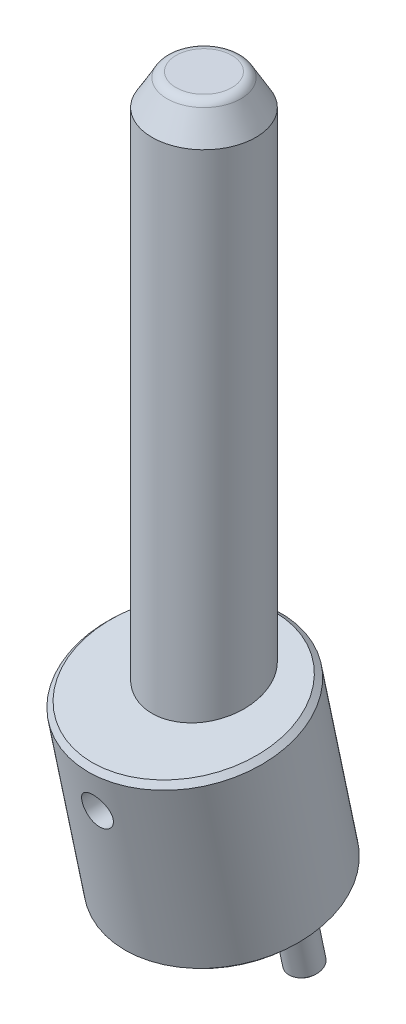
ISO-10303-21;
HEADER;
FILE_DESCRIPTION(('STEP AP214'),'2;1');
FILE_NAME('part.step','',(''),(''),'','','');
FILE_SCHEMA(('AUTOMOTIVE_DESIGN { 1 0 10303 214 1 1 1 1 }'));
ENDSEC;
DATA;
#1=APPLICATION_CONTEXT('core data for automotive mechanical design processes');
#2=APPLICATION_PROTOCOL_DEFINITION('international standard','automotive_design',2000,#1);
#3=PRODUCT_CONTEXT('',#1,'mechanical');
#4=PRODUCT('Part','Part','',(#3));
#5=PRODUCT_RELATED_PRODUCT_CATEGORY('part','',(#4));
#6=PRODUCT_DEFINITION_FORMATION('','',#4);
#7=PRODUCT_DEFINITION_CONTEXT('part definition',#1,'design');
#8=PRODUCT_DEFINITION('design','',#6,#7);
#9=PRODUCT_DEFINITION_SHAPE('','',#8);
#10=(LENGTH_UNIT() NAMED_UNIT(*) SI_UNIT(.MILLI.,.METRE.));
#11=(NAMED_UNIT(*) PLANE_ANGLE_UNIT() SI_UNIT($,.RADIAN.));
#12=(NAMED_UNIT(*) SI_UNIT($,.STERADIAN.) SOLID_ANGLE_UNIT());
#13=UNCERTAINTY_MEASURE_WITH_UNIT(LENGTH_MEASURE(1.E-05),#10,'distance_accuracy_value','');
#14=(GEOMETRIC_REPRESENTATION_CONTEXT(3) GLOBAL_UNCERTAINTY_ASSIGNED_CONTEXT((#13)) GLOBAL_UNIT_ASSIGNED_CONTEXT((#10,
#11,#12)) REPRESENTATION_CONTEXT('',''));
#15=CARTESIAN_POINT('',(0.,0.,0.));
#16=DIRECTION('',(0.,0.,1.));
#17=DIRECTION('',(1.,0.,0.));
#18=AXIS2_PLACEMENT_3D('',#15,#16,#17);
#19=CARTESIAN_POINT('',(0.,130.,0.));
#20=DIRECTION('',(0.,1.,0.));
#21=DIRECTION('',(-1.,0.,0.));
#22=AXIS2_PLACEMENT_3D('',#19,#20,#21);
#23=PLANE('',#22);
#24=CARTESIAN_POINT('',(0.,130.,0.));
#25=DIRECTION('',(0.,-1.,0.));
#26=DIRECTION('',(0.,0.,-1.));
#27=AXIS2_PLACEMENT_3D('',#24,#25,#26);
#28=CIRCLE('',#27,5.381197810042);
#29=CARTESIAN_POINT('',(0.,130.,-5.3811978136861));
#30=VERTEX_POINT('',#29);
#31=CARTESIAN_POINT('',(0.,130.,5.3811978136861));
#32=VERTEX_POINT('',#31);
#33=EDGE_CURVE('P0_E38',#30,#32,#28,.T.);
#34=ORIENTED_EDGE('',*,*,#33,.F.);
#35=CARTESIAN_POINT('',(0.,130.,0.));
#36=DIRECTION('',(0.,-1.,0.));
#37=DIRECTION('',(0.,0.,1.));
#38=AXIS2_PLACEMENT_3D('',#35,#36,#37);
#39=CIRCLE('',#38,5.381197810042);
#40=EDGE_CURVE('P0_E42',#32,#30,#39,.T.);
#41=ORIENTED_EDGE('',*,*,#40,.F.);
#42=EDGE_LOOP('',(#34,#41));
#43=FACE_BOUND('',#42,.T.);
#44=ADVANCED_FACE('P0_F17',(#43),#23,.T.);
#45=CARTESIAN_POINT('',(0.,128.,0.));
#46=DIRECTION('',(0.,1.,0.));
#47=DIRECTION('',(0.00894115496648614,0.,0.999960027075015));
#48=AXIS2_PLACEMENT_3D('',#45,#46,#47);
#49=TOROIDAL_SURFACE('',#48,5.381197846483,2.);
#50=ORIENTED_EDGE('',*,*,#33,.T.);
#51=ORIENTED_EDGE('',*,*,#40,.T.);
#52=EDGE_LOOP('',(#50,#51));
#53=FACE_BOUND('',#52,.T.);
#54=CARTESIAN_POINT('',(0.,129.000000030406,0.));
#55=DIRECTION('',(0.,-1.,0.));
#56=DIRECTION('',(0.,0.,1.));
#57=AXIS2_PLACEMENT_3D('',#54,#55,#56);
#58=CIRCLE('',#57,7.11324863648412);
#59=CARTESIAN_POINT('',(0.,129.000000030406,7.11324863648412));
#60=VERTEX_POINT('',#59);
#61=EDGE_CURVE('P0_E48',#60,#60,#58,.T.);
#62=ORIENTED_EDGE('',*,*,#61,.F.);
#63=EDGE_LOOP('',(#62));
#64=FACE_BOUND('',#63,.T.);
#65=ADVANCED_FACE('P0_F40',(#53,#64),#49,.T.);
#66=CARTESIAN_POINT('',(0.,0.,0.));
#67=DIRECTION('',(0.,1.,0.));
#68=DIRECTION('',(-1.,0.,0.));
#69=AXIS2_PLACEMENT_3D('',#66,#67,#68);
#70=PLANE('',#69);
#71=CARTESIAN_POINT('',(0.,8.84840740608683E-07,0.));
#72=DIRECTION('',(0.,1.,0.));
#73=DIRECTION('',(-1.,0.,0.));
#74=AXIS2_PLACEMENT_3D('',#71,#72,#73);
#75=CIRCLE('',#74,8.99999856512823);
#76=CARTESIAN_POINT('',(-8.99999856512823,8.84840740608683E-07,0.));
#77=VERTEX_POINT('',#76);
#78=EDGE_CURVE('P0_E85',#77,#77,#75,.T.);
#79=ORIENTED_EDGE('',*,*,#78,.F.);
#80=EDGE_LOOP('',(#79));
#81=FACE_BOUND('',#80,.T.);
#82=ADVANCED_FACE('P0_F76',(#81),#70,.F.);
#83=CARTESIAN_POINT('',(0.,17.,3.73205080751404));
#84=DIRECTION('',(0.,0.,1.));
#85=DIRECTION('',(-1.,0.,0.));
#86=AXIS2_PLACEMENT_3D('',#83,#84,#85);
#87=CONICAL_SURFACE('',#86,2.99999999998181,1.04719755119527);
#88=CARTESIAN_POINT('',(0.,16.9999999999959,1.99999999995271));
#89=VERTEX_POINT('',#88);
#90=VERTEX_LOOP('',#89);
#91=FACE_BOUND('',#90,.T.);
#92=CARTESIAN_POINT('',(0.,17.,3.732050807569));
#93=DIRECTION('',(0.,0.,1.));
#94=DIRECTION('',(0.,-1.,0.));
#95=AXIS2_PLACEMENT_3D('',#92,#93,#94);
#96=CIRCLE('',#95,3.);
#97=CARTESIAN_POINT('',(0.,14.,3.732050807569));
#98=VERTEX_POINT('',#97);
#99=EDGE_CURVE('P0_E82',#98,#98,#96,.T.);
#100=ORIENTED_EDGE('',*,*,#99,.T.);
#101=EDGE_LOOP('',(#100));
#102=FACE_BOUND('',#101,.T.);
#103=ADVANCED_FACE('P0_F116',(#91,#102),#87,.F.);
#104=CARTESIAN_POINT('',(0.,123.999999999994,0.));
#105=DIRECTION('',(0.,-1.,0.));
#106=DIRECTION('',(1.,0.,0.));
#107=AXIS2_PLACEMENT_3D('',#104,#105,#106);
#108=CONICAL_SURFACE('',#107,9.9999999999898,0.5235987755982);
#109=CARTESIAN_POINT('',(0.,124.,0.));
#110=DIRECTION('',(0.,1.,0.));
#111=DIRECTION('',(-1.,0.,0.));
#112=AXIS2_PLACEMENT_3D('',#109,#110,#111);
#113=CIRCLE('',#112,10.);
#114=CARTESIAN_POINT('',(-10.,124.,0.));
#115=VERTEX_POINT('',#114);
#116=EDGE_CURVE('P0_E92',#115,#115,#113,.F.);
#117=ORIENTED_EDGE('',*,*,#116,.F.);
#118=EDGE_LOOP('',(#117));
#119=FACE_BOUND('',#118,.T.);
#120=ORIENTED_EDGE('',*,*,#61,.T.);
#121=EDGE_LOOP('',(#120));
#122=FACE_BOUND('',#121,.T.);
#123=ADVANCED_FACE('P0_F108',(#119,#122),#108,.T.);
#124=CARTESIAN_POINT('',(0.,1.00000159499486,0.));
#125=DIRECTION('',(0.,1.,0.));
#126=DIRECTION('',(-1.,0.,0.));
#127=AXIS2_PLACEMENT_3D('',#124,#125,#126);
#128=CONICAL_SURFACE('',#127,9.99999901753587,0.785398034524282);
#129=CARTESIAN_POINT('',(0.,1.000000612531,0.));
#130=DIRECTION('',(0.,1.,0.));
#131=DIRECTION('',(-1.,0.,0.));
#132=AXIS2_PLACEMENT_3D('',#129,#130,#131);
#133=CIRCLE('',#132,10.);
#134=CARTESIAN_POINT('',(-10.,1.000000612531,0.));
#135=VERTEX_POINT('',#134);
#136=EDGE_CURVE('P0_E28',#135,#135,#133,.T.);
#137=ORIENTED_EDGE('',*,*,#136,.F.);
#138=EDGE_LOOP('',(#137));
#139=FACE_BOUND('',#138,.T.);
#140=ORIENTED_EDGE('',*,*,#78,.T.);
#141=EDGE_LOOP('',(#140));
#142=FACE_BOUND('',#141,.T.);
#143=ADVANCED_FACE('P0_F105',(#139,#142),#128,.T.);
#144=CARTESIAN_POINT('',(0.,17.,1.5));
#145=DIRECTION('',(0.,0.,1.));
#146=DIRECTION('',(0.,-1.,0.));
#147=AXIS2_PLACEMENT_3D('',#144,#145,#146);
#148=CYLINDRICAL_SURFACE('',#147,3.);
#149=ORIENTED_EDGE('',*,*,#99,.F.);
#150=EDGE_LOOP('',(#149));
#151=FACE_BOUND('',#150,.T.);
#152=CARTESIAN_POINT('',(0.,14.,10.));
#153=CARTESIAN_POINT('',(-0.164364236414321,14.0000089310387,9.99999407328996));
#154=CARTESIAN_POINT('',(-0.328908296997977,14.0135695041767,9.99590322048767));
#155=CARTESIAN_POINT('',(-0.653366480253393,14.0673818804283,9.9799606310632));
#156=CARTESIAN_POINT('',(-0.813271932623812,14.1076806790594,9.96809523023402));
#157=CARTESIAN_POINT('',(-1.12348315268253,14.2135007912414,9.93790838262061));
#158=CARTESIAN_POINT('',(-1.27380789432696,14.2789703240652,9.91960019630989));
#159=CARTESIAN_POINT('',(-1.56129290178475,14.4330996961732,9.87843514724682));
#160=CARTESIAN_POINT('',(-1.69845550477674,14.5217554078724,9.85557909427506));
#161=CARTESIAN_POINT('',(-1.95973946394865,14.7224452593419,9.80701539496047));
#162=CARTESIAN_POINT('',(-2.08342924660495,14.8350271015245,9.78124907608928));
#163=CARTESIAN_POINT('',(-2.31049290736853,15.0792112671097,9.73011807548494));
#164=CARTESIAN_POINT('',(-2.41386225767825,15.2108178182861,9.70475348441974));
#165=CARTESIAN_POINT('',(-2.59960101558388,15.4929419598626,9.65668220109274));
#166=CARTESIAN_POINT('',(-2.68144668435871,15.6438178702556,9.63404799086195));
#167=CARTESIAN_POINT('',(-2.81842825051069,15.9579795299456,9.59487230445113));
#168=CARTESIAN_POINT('',(-2.87357072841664,16.1212622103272,9.57832932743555));
#169=CARTESIAN_POINT('',(-2.95403265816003,16.4507804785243,9.5538174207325));
#170=CARTESIAN_POINT('',(-2.98014390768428,16.6168053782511,9.54562139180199));
#171=CARTESIAN_POINT('',(-3.00427461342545,16.9510662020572,9.53805579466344));
#172=CARTESIAN_POINT('',(-3.00230085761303,17.1193015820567,9.53868409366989));
#173=CARTESIAN_POINT('',(-2.9709395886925,17.4467673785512,9.54849486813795));
#174=CARTESIAN_POINT('',(-2.94254427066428,17.6061036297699,9.55736772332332));
#175=CARTESIAN_POINT('',(-2.86074869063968,17.9176387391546,9.58216703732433));
#176=CARTESIAN_POINT('',(-2.80734582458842,18.0698368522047,9.59809423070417));
#177=CARTESIAN_POINT('',(-2.67631861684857,18.3652051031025,9.6354552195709));
#178=CARTESIAN_POINT('',(-2.59837186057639,18.5082226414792,9.65696160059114));
#179=CARTESIAN_POINT('',(-2.42069837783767,18.7794716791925,9.70302119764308));
#180=CARTESIAN_POINT('',(-2.32096766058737,18.9077004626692,9.7275749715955));
#181=CARTESIAN_POINT('',(-2.09764727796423,19.1513495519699,9.77821549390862));
#182=CARTESIAN_POINT('',(-1.97323765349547,19.2660150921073,9.80432352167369));
#183=CARTESIAN_POINT('',(-1.7065766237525,19.4730741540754,9.85423611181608));
#184=CARTESIAN_POINT('',(-1.56431758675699,19.5654580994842,9.87803968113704));
#185=CARTESIAN_POINT('',(-1.26458300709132,19.7257915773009,9.92088257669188));
#186=CARTESIAN_POINT('',(-1.10700242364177,19.7935547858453,9.93988525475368));
#187=CARTESIAN_POINT('',(-0.782158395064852,19.9012737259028,9.97069163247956));
#188=CARTESIAN_POINT('',(-0.61491570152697,19.9412868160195,9.9825101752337));
#189=CARTESIAN_POINT('',(-0.371824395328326,19.9778051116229,9.99335985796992));
#190=CARTESIAN_POINT('',(-0.297737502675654,19.9861188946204,9.99584304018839));
#191=CARTESIAN_POINT('',(-0.14911274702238,19.9972183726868,9.99916445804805));
#192=CARTESIAN_POINT('',(-0.0745748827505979,20.000004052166,10.0000026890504));
#193=CARTESIAN_POINT('',(0.164364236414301,19.9999910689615,9.99999407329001));
#194=CARTESIAN_POINT('',(0.328908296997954,19.9864304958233,9.99590322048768));
#195=CARTESIAN_POINT('',(0.653366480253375,19.9326181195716,9.97996063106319));
#196=CARTESIAN_POINT('',(0.813271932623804,19.8923193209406,9.96809523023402));
#197=CARTESIAN_POINT('',(1.12348315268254,19.7864992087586,9.93790838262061));
#198=CARTESIAN_POINT('',(1.27380789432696,19.7210296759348,9.91960019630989));
#199=CARTESIAN_POINT('',(1.56129290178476,19.5669003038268,9.87843514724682));
#200=CARTESIAN_POINT('',(1.69845550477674,19.4782445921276,9.85557909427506));
#201=CARTESIAN_POINT('',(1.95973946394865,19.2775547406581,9.80701539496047));
#202=CARTESIAN_POINT('',(2.08342924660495,19.1649728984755,9.78124907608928));
#203=CARTESIAN_POINT('',(2.31049290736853,18.9207887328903,9.73011807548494));
#204=CARTESIAN_POINT('',(2.41386225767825,18.7891821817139,9.70475348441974));
#205=CARTESIAN_POINT('',(2.59960101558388,18.5070580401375,9.65668220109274));
#206=CARTESIAN_POINT('',(2.68144668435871,18.3561821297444,9.63404799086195));
#207=CARTESIAN_POINT('',(2.81842825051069,18.0420204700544,9.59487230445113));
#208=CARTESIAN_POINT('',(2.87357072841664,17.8787377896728,9.57832932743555));
#209=CARTESIAN_POINT('',(2.95403265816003,17.5492195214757,9.5538174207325));
#210=CARTESIAN_POINT('',(2.98014390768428,17.3831946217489,9.54562139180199));
#211=CARTESIAN_POINT('',(3.00427461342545,17.0489337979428,9.53805579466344));
#212=CARTESIAN_POINT('',(3.00230085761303,16.8806984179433,9.53868409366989));
#213=CARTESIAN_POINT('',(2.9709395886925,16.5532326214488,9.54849486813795));
#214=CARTESIAN_POINT('',(2.94254427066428,16.3938963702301,9.55736772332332));
#215=CARTESIAN_POINT('',(2.86074869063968,16.0823612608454,9.58216703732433));
#216=CARTESIAN_POINT('',(2.80734582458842,15.9301631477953,9.59809423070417));
#217=CARTESIAN_POINT('',(2.67631861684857,15.6347948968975,9.6354552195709));
#218=CARTESIAN_POINT('',(2.59837186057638,15.4917773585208,9.65696160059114));
#219=CARTESIAN_POINT('',(2.42069837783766,15.2205283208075,9.70302119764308));
#220=CARTESIAN_POINT('',(2.32096766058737,15.0922995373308,9.7275749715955));
#221=CARTESIAN_POINT('',(2.09764727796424,14.8486504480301,9.77821549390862));
#222=CARTESIAN_POINT('',(1.97323765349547,14.7339849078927,9.80432352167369));
#223=CARTESIAN_POINT('',(1.7065766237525,14.5269258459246,9.85423611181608));
#224=CARTESIAN_POINT('',(1.56431758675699,14.4345419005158,9.87803968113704));
#225=CARTESIAN_POINT('',(1.26458300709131,14.2742084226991,9.92088257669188));
#226=CARTESIAN_POINT('',(1.10700242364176,14.2064452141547,9.93988525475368));
#227=CARTESIAN_POINT('',(0.782158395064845,14.0987262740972,9.97069163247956));
#228=CARTESIAN_POINT('',(0.614915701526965,14.0587131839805,9.9825101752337));
#229=CARTESIAN_POINT('',(0.371824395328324,14.0221948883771,9.99335985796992));
#230=CARTESIAN_POINT('',(0.297737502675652,14.0138811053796,9.9958430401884));
#231=CARTESIAN_POINT('',(0.149112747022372,14.0027816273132,9.99916445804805));
#232=CARTESIAN_POINT('',(0.0745748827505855,13.999995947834,10.0000026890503));
#233=CARTESIAN_POINT('',(0.,14.,10.));
#234=B_SPLINE_CURVE_WITH_KNOTS('',3,(#152,#153,#154,#155,#156,#157,#158,#159,#160,#161,#162,
#163,#164,#165,#166,#167,#168,#169,#170,#171,#172,#173,#174,#175,#176,#177,#178,#179,#180,#181,
#182,#183,#184,#185,#186,#187,#188,#189,#190,#191,#192,#193,#194,#195,#196,#197,#198,#199,#200,
#201,#202,#203,#204,#205,#206,#207,#208,#209,#210,#211,#212,#213,#214,#215,#216,#217,#218,#219,
#220,#221,#222,#223,#224,#225,#226,#227,#228,#229,#230,#231,#232,#233),.UNSPECIFIED.,.T.,.F.,(4,
2,2,2,2,2,2,2,2,2,2,2,2,2,2,2,2,2,2,2,2,2,2,2,2,2,2,2,2,2,2,2,2,2,2,2,2,2,2,2,4),(0.,
0.49280574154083,0.98647994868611,1.47914396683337,1.97172034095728,2.47709830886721,
2.98258875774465,3.49943124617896,4.01614630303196,4.51839363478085,5.02051957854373,
5.50451902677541,5.98856888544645,6.47926306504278,6.97004721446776,7.48124851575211,
7.99266913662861,8.507883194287,9.02202912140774,9.24562293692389,9.4692173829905,
9.96202312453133,10.4556973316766,10.9483613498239,11.4409377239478,11.9463156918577,
12.4518061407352,12.9686486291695,13.4853636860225,13.9876110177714,14.4897369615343,
14.9737364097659,15.457786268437,15.9484804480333,16.4392645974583,16.9504658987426,
17.4618865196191,17.9771005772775,18.4912465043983,18.7148403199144,18.938434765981),.UNSPECIFIED.);
#235=CARTESIAN_POINT('',(0.,14.,10.));
#236=VERTEX_POINT('',#235);
#237=EDGE_CURVE('P0_E11',#236,#236,#234,.T.);
#238=ORIENTED_EDGE('',*,*,#237,.F.);
#239=EDGE_LOOP('',(#238));
#240=FACE_BOUND('',#239,.T.);
#241=ADVANCED_FACE('P0_F107',(#151,#240),#148,.F.);
#242=CARTESIAN_POINT('',(0.,-6.5,0.));
#243=DIRECTION('',(0.,1.,0.));
#244=DIRECTION('',(-1.,0.,0.));
#245=AXIS2_PLACEMENT_3D('',#242,#243,#244);
#246=CYLINDRICAL_SURFACE('',#245,10.);
#247=ORIENTED_EDGE('',*,*,#116,.T.);
#248=EDGE_LOOP('',(#247));
#249=FACE_BOUND('',#248,.T.);
#250=ORIENTED_EDGE('',*,*,#136,.T.);
#251=EDGE_LOOP('',(#250));
#252=FACE_BOUND('',#251,.T.);
#253=ORIENTED_EDGE('',*,*,#237,.T.);
#254=EDGE_LOOP('',(#253));
#255=FACE_BOUND('',#254,.T.);
#256=ADVANCED_FACE('P0_F102',(#249,#252,#255),#246,.T.);
#257=CLOSED_SHELL('',(#44,#65,#82,#103,#123,#143,#241,#256));
#258=MANIFOLD_SOLID_BREP('P0_B1',#257);
#259=CARTESIAN_POINT('',(0.,-14.8482887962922,-5.4434356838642));
#260=DIRECTION('',(0.,-0.978147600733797,-0.207911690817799));
#261=DIRECTION('',(0.,0.207911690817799,-0.978147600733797));
#262=AXIS2_PLACEMENT_3D('',#259,#260,#261);
#263=PLANE('',#262);
#264=CARTESIAN_POINT('',(-14.,-14.8482887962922,-5.4434356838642));
#265=DIRECTION('',(0.,-0.978147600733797,-0.207911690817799));
#266=DIRECTION('',(0.,0.207911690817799,-0.978147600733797));
#267=AXIS2_PLACEMENT_3D('',#264,#265,#266);
#268=CIRCLE('',#267,2.49998893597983);
#269=CARTESIAN_POINT('',(-14.,-14.3285118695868,-7.8887938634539));
#270=VERTEX_POINT('',#269);
#271=EDGE_CURVE('P1_E17',#270,#270,#268,.F.);
#272=ORIENTED_EDGE('',*,*,#271,.F.);
#273=EDGE_LOOP('',(#272));
#274=FACE_BOUND('',#273,.T.);
#275=ADVANCED_FACE('P1_F14',(#274),#263,.T.);
#276=CARTESIAN_POINT('',(0.,-14.8482887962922,-5.4434356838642));
#277=DIRECTION('',(0.,-0.978147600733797,-0.207911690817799));
#278=DIRECTION('',(0.,0.207911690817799,-0.978147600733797));
#279=AXIS2_PLACEMENT_3D('',#276,#277,#278);
#280=PLANE('',#279);
#281=CARTESIAN_POINT('',(14.,-14.8482887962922,-5.4434356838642));
#282=DIRECTION('',(0.,-0.978147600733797,-0.207911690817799));
#283=DIRECTION('',(0.,0.207911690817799,-0.978147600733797));
#284=AXIS2_PLACEMENT_3D('',#281,#282,#283);
#285=CIRCLE('',#284,2.49998893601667);
#286=CARTESIAN_POINT('',(14.,-14.3285118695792,-7.88879386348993));
#287=VERTEX_POINT('',#286);
#288=EDGE_CURVE('P1_E114',#287,#287,#285,.F.);
#289=ORIENTED_EDGE('',*,*,#288,.F.);
#290=EDGE_LOOP('',(#289));
#291=FACE_BOUND('',#290,.T.);
#292=ADVANCED_FACE('P1_F104',(#291),#280,.T.);
#293=CARTESIAN_POINT('',(0.,0.,6.11490025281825E-13));
#294=DIRECTION('',(0.,-1.,0.));
#295=DIRECTION('',(0.,0.,-1.));
#296=AXIS2_PLACEMENT_3D('',#293,#294,#295);
#297=PLANE('',#296);
#298=CARTESIAN_POINT('',(0.,0.,2.39088263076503E-12));
#299=DIRECTION('',(0.,-1.,0.));
#300=DIRECTION('',(0.,0.,-1.));
#301=AXIS2_PLACEMENT_3D('',#298,#299,#300);
#302=CIRCLE('',#301,10.);
#303=CARTESIAN_POINT('',(0.,0.,-9.99999999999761));
#304=VERTEX_POINT('',#303);
#305=EDGE_CURVE('P1_E116',#304,#304,#302,.F.);
#306=ORIENTED_EDGE('',*,*,#305,.T.);
#307=EDGE_LOOP('',(#306));
#308=FACE_BOUND('',#307,.T.);
#309=ADVANCED_FACE('P1_F101',(#308),#297,.F.);
#310=CARTESIAN_POINT('',(-14.,-14.3592066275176,-5.33947805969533));
#311=DIRECTION('',(0.,0.978147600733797,0.207911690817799));
#312=DIRECTION('',(0.,-0.207911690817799,0.978147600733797));
#313=AXIS2_PLACEMENT_3D('',#310,#311,#312);
#314=CONICAL_SURFACE('',#313,2.99999527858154,0.785395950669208);
#315=CARTESIAN_POINT('',(-14.,-14.359202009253,-5.33947707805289));
#316=DIRECTION('',(0.,0.978147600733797,0.207911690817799));
#317=DIRECTION('',(0.,-0.207911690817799,0.978147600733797));
#318=AXIS2_PLACEMENT_3D('',#315,#316,#317);
#319=CIRCLE('',#318,3.);
#320=CARTESIAN_POINT('',(-14.,-14.9829370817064,-2.4050342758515));
#321=VERTEX_POINT('',#320);
#322=EDGE_CURVE('P1_E118',#321,#321,#319,.T.);
#323=ORIENTED_EDGE('',*,*,#322,.F.);
#324=EDGE_LOOP('',(#323));
#325=FACE_BOUND('',#324,.T.);
#326=ORIENTED_EDGE('',*,*,#271,.T.);
#327=EDGE_LOOP('',(#326));
#328=FACE_BOUND('',#327,.T.);
#329=ADVANCED_FACE('P1_F97',(#325,#328),#314,.T.);
#330=CARTESIAN_POINT('',(14.,-14.3592066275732,-5.33947805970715));
#331=DIRECTION('',(0.,0.978147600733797,0.207911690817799));
#332=DIRECTION('',(0.,-0.207911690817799,0.978147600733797));
#333=AXIS2_PLACEMENT_3D('',#330,#331,#332);
#334=CONICAL_SURFACE('',#333,2.99999527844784,0.785395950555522);
#335=CARTESIAN_POINT('',(14.,-14.3592020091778,-5.33947707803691));
#336=DIRECTION('',(0.,0.978147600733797,0.207911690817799));
#337=DIRECTION('',(0.,-0.207911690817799,0.978147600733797));
#338=AXIS2_PLACEMENT_3D('',#335,#336,#337);
#339=CIRCLE('',#338,3.);
#340=CARTESIAN_POINT('',(14.,-14.9829370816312,-2.40503427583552));
#341=VERTEX_POINT('',#340);
#342=EDGE_CURVE('P1_E123',#341,#341,#339,.T.);
#343=ORIENTED_EDGE('',*,*,#342,.F.);
#344=EDGE_LOOP('',(#343));
#345=FACE_BOUND('',#344,.T.);
#346=ORIENTED_EDGE('',*,*,#288,.T.);
#347=EDGE_LOOP('',(#346));
#348=FACE_BOUND('',#347,.T.);
#349=ADVANCED_FACE('P1_F92',(#345,#348),#334,.T.);
#350=CARTESIAN_POINT('',(0.,44.237051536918,2.39131631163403E-12));
#351=DIRECTION('',(0.,-1.,0.));
#352=DIRECTION('',(0.,0.,-1.));
#353=AXIS2_PLACEMENT_3D('',#350,#351,#352);
#354=CYLINDRICAL_SURFACE('',#353,10.);
#355=CARTESIAN_POINT('',(0.,29.9999999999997,2.39131631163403E-12));
#356=DIRECTION('',(0.,0.978147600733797,0.207911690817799));
#357=DIRECTION('',(0.,-0.207911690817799,0.978147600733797));
#358=AXIS2_PLACEMENT_3D('',#355,#356,#357);
#359=ELLIPSE('',#358,10.2234059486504,10.);
#360=CARTESIAN_POINT('',(0.,27.8744343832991,10.0000000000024));
#361=VERTEX_POINT('',#360);
#362=EDGE_CURVE('P1_E79',#361,#361,#359,.F.);
#363=ORIENTED_EDGE('',*,*,#362,.F.);
#364=EDGE_LOOP('',(#363));
#365=FACE_BOUND('',#364,.T.);
#366=ORIENTED_EDGE('',*,*,#305,.F.);
#367=EDGE_LOOP('',(#366));
#368=FACE_BOUND('',#367,.T.);
#369=CARTESIAN_POINT('',(0.,19.9999999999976,10.0000000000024));
#370=CARTESIAN_POINT('',(-0.16436423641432,19.9999910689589,9.99999407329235));
#371=CARTESIAN_POINT('',(-0.328908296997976,19.9864304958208,9.99590322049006));
#372=CARTESIAN_POINT('',(-0.653366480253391,19.9326181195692,9.97996063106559));
#373=CARTESIAN_POINT('',(-0.813271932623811,19.8923193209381,9.96809523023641));
#374=CARTESIAN_POINT('',(-1.12348315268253,19.7864992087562,9.937908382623));
#375=CARTESIAN_POINT('',(-1.27380789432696,19.7210296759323,9.91960019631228));
#376=CARTESIAN_POINT('',(-1.56129290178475,19.5669003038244,9.87843514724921));
#377=CARTESIAN_POINT('',(-1.69845550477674,19.4782445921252,9.85557909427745));
#378=CARTESIAN_POINT('',(-1.95973946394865,19.2775547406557,9.80701539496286));
#379=CARTESIAN_POINT('',(-2.08342924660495,19.1649728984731,9.78124907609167));
#380=CARTESIAN_POINT('',(-2.31049290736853,18.9207887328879,9.73011807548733));
#381=CARTESIAN_POINT('',(-2.41386225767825,18.7891821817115,9.70475348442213));
#382=CARTESIAN_POINT('',(-2.59960101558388,18.507058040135,9.65668220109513));
#383=CARTESIAN_POINT('',(-2.68144668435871,18.356182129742,9.63404799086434));
#384=CARTESIAN_POINT('',(-2.81842825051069,18.042020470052,9.59487230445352));
#385=CARTESIAN_POINT('',(-2.87357072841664,17.8787377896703,9.57832932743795));
#386=CARTESIAN_POINT('',(-2.95403265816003,17.5492195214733,9.55381742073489));
#387=CARTESIAN_POINT('',(-2.98014390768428,17.3831946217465,9.54562139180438));
#388=CARTESIAN_POINT('',(-3.00427461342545,17.0489337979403,9.53805579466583));
#389=CARTESIAN_POINT('',(-3.00230085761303,16.8806984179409,9.53868409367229));
#390=CARTESIAN_POINT('',(-2.9709395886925,16.5532326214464,9.54849486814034));
#391=CARTESIAN_POINT('',(-2.94254427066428,16.3938963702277,9.55736772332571));
#392=CARTESIAN_POINT('',(-2.86074869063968,16.082361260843,9.58216703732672));
#393=CARTESIAN_POINT('',(-2.80734582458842,15.9301631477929,9.59809423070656));
#394=CARTESIAN_POINT('',(-2.67631861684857,15.6347948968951,9.63545521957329));
#395=CARTESIAN_POINT('',(-2.59837186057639,15.4917773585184,9.65696160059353));
#396=CARTESIAN_POINT('',(-2.42069837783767,15.220528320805,9.70302119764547));
#397=CARTESIAN_POINT('',(-2.32096766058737,15.0922995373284,9.72757497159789));
#398=CARTESIAN_POINT('',(-2.09764727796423,14.8486504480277,9.77821549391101));
#399=CARTESIAN_POINT('',(-1.97323765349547,14.7339849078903,9.80432352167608));
#400=CARTESIAN_POINT('',(-1.7065766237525,14.5269258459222,9.85423611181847));
#401=CARTESIAN_POINT('',(-1.56431758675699,14.4345419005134,9.87803968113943));
#402=CARTESIAN_POINT('',(-1.26458300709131,14.2742084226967,9.92088257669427));
#403=CARTESIAN_POINT('',(-1.10700242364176,14.2064452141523,9.93988525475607));
#404=CARTESIAN_POINT('',(-0.78215839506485,14.0987262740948,9.97069163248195));
#405=CARTESIAN_POINT('',(-0.614915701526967,14.058713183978,9.9825101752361));
#406=CARTESIAN_POINT('',(-0.371824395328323,14.0221948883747,9.99335985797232));
#407=CARTESIAN_POINT('',(-0.297737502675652,14.0138811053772,9.99584304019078));
#408=CARTESIAN_POINT('',(-0.149112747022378,14.0027816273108,9.99916445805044));
#409=CARTESIAN_POINT('',(-0.0745748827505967,13.9999959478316,10.0000026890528));
#410=CARTESIAN_POINT('',(0.164364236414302,14.0000089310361,9.9999940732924));
#411=CARTESIAN_POINT('',(0.328908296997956,14.0135695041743,9.99590322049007));
#412=CARTESIAN_POINT('',(0.653366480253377,14.0673818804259,9.97996063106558));
#413=CARTESIAN_POINT('',(0.813271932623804,14.107680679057,9.96809523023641));
#414=CARTESIAN_POINT('',(1.12348315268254,14.213500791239,9.937908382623));
#415=CARTESIAN_POINT('',(1.27380789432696,14.2789703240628,9.91960019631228));
#416=CARTESIAN_POINT('',(1.56129290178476,14.4330996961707,9.87843514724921));
#417=CARTESIAN_POINT('',(1.69845550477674,14.52175540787,9.85557909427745));
#418=CARTESIAN_POINT('',(1.95973946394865,14.7224452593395,9.80701539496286));
#419=CARTESIAN_POINT('',(2.08342924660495,14.8350271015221,9.78124907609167));
#420=CARTESIAN_POINT('',(2.31049290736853,15.0792112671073,9.73011807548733));
#421=CARTESIAN_POINT('',(2.41386225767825,15.2108178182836,9.70475348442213));
#422=CARTESIAN_POINT('',(2.59960101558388,15.4929419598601,9.65668220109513));
#423=CARTESIAN_POINT('',(2.68144668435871,15.6438178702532,9.63404799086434));
#424=CARTESIAN_POINT('',(2.81842825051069,15.9579795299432,9.59487230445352));
#425=CARTESIAN_POINT('',(2.87357072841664,16.1212622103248,9.57832932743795));
#426=CARTESIAN_POINT('',(2.95403265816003,16.4507804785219,9.55381742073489));
#427=CARTESIAN_POINT('',(2.98014390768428,16.6168053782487,9.54562139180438));
#428=CARTESIAN_POINT('',(3.00427461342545,16.9510662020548,9.53805579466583));
#429=CARTESIAN_POINT('',(3.00230085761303,17.1193015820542,9.53868409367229));
#430=CARTESIAN_POINT('',(2.9709395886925,17.4467673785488,9.54849486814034));
#431=CARTESIAN_POINT('',(2.94254427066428,17.6061036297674,9.55736772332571));
#432=CARTESIAN_POINT('',(2.86074869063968,17.9176387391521,9.58216703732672));
#433=CARTESIAN_POINT('',(2.80734582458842,18.0698368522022,9.59809423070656));
#434=CARTESIAN_POINT('',(2.67631861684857,18.3652051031,9.63545521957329));
#435=CARTESIAN_POINT('',(2.59837186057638,18.5082226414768,9.65696160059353));
#436=CARTESIAN_POINT('',(2.42069837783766,18.7794716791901,9.70302119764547));
#437=CARTESIAN_POINT('',(2.32096766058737,18.9077004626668,9.72757497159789));
#438=CARTESIAN_POINT('',(2.09764727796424,19.1513495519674,9.77821549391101));
#439=CARTESIAN_POINT('',(1.97323765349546,19.2660150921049,9.80432352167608));
#440=CARTESIAN_POINT('',(1.70657662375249,19.473074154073,9.85423611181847));
#441=CARTESIAN_POINT('',(1.56431758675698,19.5654580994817,9.87803968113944));
#442=CARTESIAN_POINT('',(1.26458300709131,19.7257915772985,9.92088257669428));
#443=CARTESIAN_POINT('',(1.10700242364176,19.7935547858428,9.93988525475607));
#444=CARTESIAN_POINT('',(0.782158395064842,19.9012737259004,9.97069163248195));
#445=CARTESIAN_POINT('',(0.614915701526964,19.9412868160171,9.98251017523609));
#446=CARTESIAN_POINT('',(0.371824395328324,19.9778051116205,9.99335985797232));
#447=CARTESIAN_POINT('',(0.297737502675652,19.986118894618,9.99584304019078));
#448=CARTESIAN_POINT('',(0.149112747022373,19.9972183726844,9.99916445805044));
#449=CARTESIAN_POINT('',(0.0745748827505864,20.0000040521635,10.0000026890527));
#450=CARTESIAN_POINT('',(0.,19.9999999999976,10.0000000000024));
#451=B_SPLINE_CURVE_WITH_KNOTS('',3,(#369,#370,#371,#372,#373,#374,#375,#376,#377,#378,#379,
#380,#381,#382,#383,#384,#385,#386,#387,#388,#389,#390,#391,#392,#393,#394,#395,#396,#397,#398,
#399,#400,#401,#402,#403,#404,#405,#406,#407,#408,#409,#410,#411,#412,#413,#414,#415,#416,#417,
#418,#419,#420,#421,#422,#423,#424,#425,#426,#427,#428,#429,#430,#431,#432,#433,#434,#435,#436,
#437,#438,#439,#440,#441,#442,#443,#444,#445,#446,#447,#448,#449,#450),.UNSPECIFIED.,.T.,.F.,(4,
2,2,2,2,2,2,2,2,2,2,2,2,2,2,2,2,2,2,2,2,2,2,2,2,2,2,2,2,2,2,2,2,2,2,2,2,2,2,2,4),(0.,
0.49280574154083,0.986479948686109,1.47914396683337,1.97172034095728,2.47709830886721,
2.98258875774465,3.49943124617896,4.01614630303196,4.51839363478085,5.02051957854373,
5.50451902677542,5.98856888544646,6.47926306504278,6.97004721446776,7.48124851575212,
7.99266913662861,8.507883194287,9.02202912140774,9.2456229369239,9.46921738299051,
9.96202312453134,10.4556973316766,10.9483613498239,11.4409377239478,11.9463156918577,
12.4518061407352,12.9686486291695,13.4853636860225,13.9876110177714,14.4897369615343,
14.9737364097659,15.457786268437,15.9484804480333,16.4392645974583,16.9504658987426,
17.4618865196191,17.9771005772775,18.4912465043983,18.7148403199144,18.938434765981),.UNSPECIFIED.);
#452=CARTESIAN_POINT('',(0.,19.9999999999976,10.0000000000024));
#453=VERTEX_POINT('',#452);
#454=EDGE_CURVE('P1_E76',#453,#453,#451,.T.);
#455=ORIENTED_EDGE('',*,*,#454,.T.);
#456=EDGE_LOOP('',(#455));
#457=FACE_BOUND('',#456,.T.);
#458=ADVANCED_FACE('P1_F86',(#365,#368,#457),#354,.F.);
#459=CARTESIAN_POINT('',(-14.,-6.044960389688,-3.572230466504));
#460=DIRECTION('',(0.,-0.978147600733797,-0.207911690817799));
#461=DIRECTION('',(0.,0.207911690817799,-0.978147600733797));
#462=AXIS2_PLACEMENT_3D('',#459,#460,#461);
#463=CYLINDRICAL_SURFACE('',#462,3.);
#464=CARTESIAN_POINT('',(-14.,-6.044960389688,-3.572230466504));
#465=DIRECTION('',(0.,-0.978147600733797,-0.207911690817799));
#466=DIRECTION('',(0.,0.207911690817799,-0.978147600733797));
#467=AXIS2_PLACEMENT_3D('',#464,#465,#466);
#468=CIRCLE('',#467,3.);
#469=CARTESIAN_POINT('',(-14.,-5.4212253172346,-6.50667326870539));
#470=VERTEX_POINT('',#469);
#471=EDGE_CURVE('P1_E72',#470,#470,#468,.T.);
#472=ORIENTED_EDGE('',*,*,#471,.T.);
#473=EDGE_LOOP('',(#472));
#474=FACE_BOUND('',#473,.T.);
#475=ORIENTED_EDGE('',*,*,#322,.T.);
#476=EDGE_LOOP('',(#475));
#477=FACE_BOUND('',#476,.T.);
#478=ADVANCED_FACE('P1_F91',(#474,#477),#463,.T.);
#479=CARTESIAN_POINT('',(14.,-6.044960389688,-3.572230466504));
#480=DIRECTION('',(0.,-0.978147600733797,-0.207911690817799));
#481=DIRECTION('',(0.,0.207911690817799,-0.978147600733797));
#482=AXIS2_PLACEMENT_3D('',#479,#480,#481);
#483=CYLINDRICAL_SURFACE('',#482,3.);
#484=CARTESIAN_POINT('',(14.,-6.044960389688,-3.572230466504));
#485=DIRECTION('',(0.,-0.978147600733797,-0.207911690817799));
#486=DIRECTION('',(0.,0.207911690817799,-0.978147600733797));
#487=AXIS2_PLACEMENT_3D('',#484,#485,#486);
#488=CIRCLE('',#487,3.);
#489=CARTESIAN_POINT('',(14.,-5.4212253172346,-6.50667326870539));
#490=VERTEX_POINT('',#489);
#491=EDGE_CURVE('P1_E68',#490,#490,#488,.T.);
#492=ORIENTED_EDGE('',*,*,#491,.T.);
#493=EDGE_LOOP('',(#492));
#494=FACE_BOUND('',#493,.T.);
#495=ORIENTED_EDGE('',*,*,#342,.T.);
#496=EDGE_LOOP('',(#495));
#497=FACE_BOUND('',#496,.T.);
#498=ADVANCED_FACE('P1_F139',(#494,#497),#483,.T.);
#499=CARTESIAN_POINT('',(0.,29.1683532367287,3.91259040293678));
#500=DIRECTION('',(0.,0.978147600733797,0.207911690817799));
#501=DIRECTION('',(0.,-0.207911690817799,0.978147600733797));
#502=AXIS2_PLACEMENT_3D('',#499,#500,#501);
#503=PLANE('',#502);
#504=ORIENTED_EDGE('',*,*,#362,.T.);
#505=EDGE_LOOP('',(#504));
#506=FACE_BOUND('',#505,.T.);
#507=CARTESIAN_POINT('',(0.,29.1683532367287,3.91259040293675));
#508=DIRECTION('',(0.,0.978147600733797,0.207911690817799));
#509=DIRECTION('',(0.,-0.207911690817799,0.978147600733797));
#510=AXIS2_PLACEMENT_3D('',#507,#508,#509);
#511=CIRCLE('',#510,17.9999935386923);
#512=CARTESIAN_POINT('',(0.,25.4259441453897,21.5192408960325));
#513=VERTEX_POINT('',#512);
#514=EDGE_CURVE('P1_E38',#513,#513,#511,.F.);
#515=ORIENTED_EDGE('',*,*,#514,.F.);
#516=EDGE_LOOP('',(#515));
#517=FACE_BOUND('',#516,.T.);
#518=ADVANCED_FACE('P1_F63',(#506,#517),#503,.T.);
#519=CARTESIAN_POINT('',(0.,16.9999999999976,-4.82171245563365));
#520=DIRECTION('',(0.,0.,1.));
#521=DIRECTION('',(0.,-1.,0.));
#522=AXIS2_PLACEMENT_3D('',#519,#520,#521);
#523=CYLINDRICAL_SURFACE('',#522,3.);
#524=ORIENTED_EDGE('',*,*,#454,.F.);
#525=EDGE_LOOP('',(#524));
#526=FACE_BOUND('',#525,.T.);
#527=CARTESIAN_POINT('',(0.,13.9999999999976,20.1129286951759));
#528=CARTESIAN_POINT('',(-0.168060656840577,14.0000075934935,20.1129271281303));
#529=CARTESIAN_POINT('',(-0.336324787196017,14.0141776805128,20.113637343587));
#530=CARTESIAN_POINT('',(-0.66831005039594,14.0705278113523,20.1166455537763));
#531=CARTESIAN_POINT('',(-0.832021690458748,14.1127623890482,20.1189466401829));
#532=CARTESIAN_POINT('',(-1.14992778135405,14.2240338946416,20.1256224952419));
#533=CARTESIAN_POINT('',(-1.30412869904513,14.2930523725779,20.1299958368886));
#534=CARTESIAN_POINT('',(-1.59863957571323,14.455858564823,20.1415355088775));
#535=CARTESIAN_POINT('',(-1.73895560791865,14.5496353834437,20.1487006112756));
#536=CARTESIAN_POINT('',(-2.0015987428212,14.7590691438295,20.1666574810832));
#537=CARTESIAN_POINT('',(-2.12395042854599,14.8746956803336,20.1774442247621));
#538=CARTESIAN_POINT('',(-2.34744205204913,15.1244732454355,20.2034646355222));
#539=CARTESIAN_POINT('',(-2.44858129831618,15.2586248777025,20.2186984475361));
#540=CARTESIAN_POINT('',(-2.62665141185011,15.5410605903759,20.2541987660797));
#541=CARTESIAN_POINT('',(-2.70364108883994,15.689309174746,20.2744528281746));
#542=CARTESIAN_POINT('',(-2.83180978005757,15.9957861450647,20.3203046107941));
#543=CARTESIAN_POINT('',(-2.88298883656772,16.1540145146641,20.3459023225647));
#544=CARTESIAN_POINT('',(-2.95871782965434,16.4768746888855,20.4024846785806));
#545=CARTESIAN_POINT('',(-2.98309542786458,16.6415409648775,20.4335027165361));
#546=CARTESIAN_POINT('',(-3.00442603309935,16.9716945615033,20.5001993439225));
#547=CARTESIAN_POINT('',(-3.00137559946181,17.1371819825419,20.5358785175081));
#548=CARTESIAN_POINT('',(-2.96797202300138,17.4685445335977,20.6117439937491));
#549=CARTESIAN_POINT('',(-2.93696459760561,17.6343334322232,20.65201799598));
#550=CARTESIAN_POINT('',(-2.84791090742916,17.9579025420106,20.7348169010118));
#551=CARTESIAN_POINT('',(-2.7898589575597,18.115681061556,20.7773422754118));
#552=CARTESIAN_POINT('',(-2.64618592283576,18.4238940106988,20.8640930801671));
#553=CARTESIAN_POINT('',(-2.55978257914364,18.5739609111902,20.908330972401));
#554=CARTESIAN_POINT('',(-2.36218685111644,18.8573969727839,20.9949634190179));
#555=CARTESIAN_POINT('',(-2.2509936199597,18.9907655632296,21.0373579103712));
#556=CARTESIAN_POINT('',(-2.00600000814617,19.2374735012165,21.1180347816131));
#557=CARTESIAN_POINT('',(-1.87211323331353,19.3507327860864,21.1563004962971));
#558=CARTESIAN_POINT('',(-1.58541320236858,19.5528894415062,21.2260491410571));
#559=CARTESIAN_POINT('',(-1.43259581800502,19.6417814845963,21.2575305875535));
#560=CARTESIAN_POINT('',(-1.11875871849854,19.788747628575,21.310298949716));
#561=CARTESIAN_POINT('',(-0.958322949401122,19.847925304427,21.3319475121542));
#562=CARTESIAN_POINT('',(-0.711539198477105,19.9156492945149,21.3568968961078));
#563=CARTESIAN_POINT('',(-0.628315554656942,19.9347109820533,21.3639571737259));
#564=CARTESIAN_POINT('',(-0.460386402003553,19.9656896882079,21.375461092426));
#565=CARTESIAN_POINT('',(-0.375681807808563,19.9776109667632,21.3799062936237));
#566=CARTESIAN_POINT('',(-0.242330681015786,19.9905902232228,21.3847508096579));
#567=CARTESIAN_POINT('',(-0.193942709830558,19.9941167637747,21.3860685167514));
#568=CARTESIAN_POINT('',(-0.0970435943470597,19.9988229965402,21.3878278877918));
#569=CARTESIAN_POINT('',(-0.0485324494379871,20.0000026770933,21.388269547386));
#570=CARTESIAN_POINT('',(0.161317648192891,19.9999911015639,21.3882631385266));
#571=CARTESIAN_POINT('',(0.322870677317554,19.9869190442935,21.3833622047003));
#572=CARTESIAN_POINT('',(0.641437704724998,19.9350831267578,21.364084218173));
#573=CARTESIAN_POINT('',(0.798440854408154,19.8962624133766,21.3496861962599));
#574=CARTESIAN_POINT('',(1.10291739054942,19.794505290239,21.3124594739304));
#575=CARTESIAN_POINT('',(1.25041369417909,19.7316296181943,21.2896520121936));
#576=CARTESIAN_POINT('',(1.53250848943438,19.583945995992,21.2370852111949));
#577=CARTESIAN_POINT('',(1.66711089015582,19.4991447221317,21.207327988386));
#578=CARTESIAN_POINT('',(1.92464322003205,19.3070314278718,21.141525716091));
#579=CARTESIAN_POINT('',(2.04704465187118,19.1990716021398,21.1053062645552));
#580=CARTESIAN_POINT('',(2.27230288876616,18.9654495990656,21.0293029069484));
#581=CARTESIAN_POINT('',(2.37515309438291,18.8397814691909,20.9895178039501));
#582=CARTESIAN_POINT('',(2.56413753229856,18.5666073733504,20.9061523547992));
#583=CARTESIAN_POINT('',(2.64905309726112,18.41828388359,20.8624833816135));
#584=CARTESIAN_POINT('',(2.79258421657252,18.1092808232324,20.7755722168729));
#585=CARTESIAN_POINT('',(2.85119573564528,17.9485993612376,20.7323300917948));
#586=CARTESIAN_POINT('',(2.94131995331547,17.615617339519,20.6473452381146));
#587=CARTESIAN_POINT('',(2.97224979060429,17.4431456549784,20.605651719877));
#588=CARTESIAN_POINT('',(3.00361307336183,17.0945001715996,20.5264397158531));
#589=CARTESIAN_POINT('',(3.0040501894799,16.9183268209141,20.4889207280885));
#590=CARTESIAN_POINT('',(2.97418777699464,16.571101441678,20.4199784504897));
#591=CARTESIAN_POINT('',(2.94450803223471,16.4000177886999,20.388447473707));
#592=CARTESIAN_POINT('',(2.85572863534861,16.0646468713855,20.3311794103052));
#593=CARTESIAN_POINT('',(2.79663406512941,15.9003584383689,20.3054413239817));
#594=CARTESIAN_POINT('',(2.65270674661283,15.588722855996,20.2605113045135));
#595=CARTESIAN_POINT('',(2.56871805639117,15.4410108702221,20.2411429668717));
#596=CARTESIAN_POINT('',(2.37669719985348,15.1615094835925,20.2074985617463));
#597=CARTESIAN_POINT('',(2.26866880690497,15.0297175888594,20.1932216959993));
#598=CARTESIAN_POINT('',(2.03340931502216,14.7879230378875,20.1692191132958));
#599=CARTESIAN_POINT('',(1.90648693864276,14.6776260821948,20.1594290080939));
#600=CARTESIAN_POINT('',(1.63581033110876,14.479633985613,20.1432512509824));
#601=CARTESIAN_POINT('',(1.49204906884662,14.3919483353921,20.1368650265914));
#602=CARTESIAN_POINT('',(1.19175300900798,14.241748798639,20.1266768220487));
#603=CARTESIAN_POINT('',(1.03520950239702,14.1792522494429,20.1228766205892));
#604=CARTESIAN_POINT('',(0.714048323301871,14.0814013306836,20.1172012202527));
#605=CARTESIAN_POINT('',(0.549446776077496,14.0459949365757,20.1153223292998));
#606=CARTESIAN_POINT('',(0.319699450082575,14.0163924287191,20.1137728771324));
#607=CARTESIAN_POINT('',(0.255923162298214,14.0102501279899,20.1134551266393));
#608=CARTESIAN_POINT('',(0.12810777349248,14.0020524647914,20.1130333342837));
#609=CARTESIAN_POINT('',(0.064068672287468,13.9999971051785,20.1129292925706));
#610=CARTESIAN_POINT('',(0.,13.9999999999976,20.1129286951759));
#611=B_SPLINE_CURVE_WITH_KNOTS('',3,(#527,#528,#529,#530,#531,#532,#533,#534,#535,#536,#537,
#538,#539,#540,#541,#542,#543,#544,#545,#546,#547,#548,#549,#550,#551,#552,#553,#554,#555,#556,
#557,#558,#559,#560,#561,#562,#563,#564,#565,#566,#567,#568,#569,#570,#571,#572,#573,#574,#575,
#576,#577,#578,#579,#580,#581,#582,#583,#584,#585,#586,#587,#588,#589,#590,#591,#592,#593,#594,
#595,#596,#597,#598,#599,#600,#601,#602,#603,#604,#605,#606,#607,#608,#609,#610),.UNSPECIFIED.,
.T.,.F.,(4,2,2,2,2,2,2,2,2,2,2,2,2,2,2,2,2,2,2,2,2,2,2,2,2,2,2,2,2,2,2,2,2,2,2,2,2,2,2,2,2,4),
(0.,0.503941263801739,1.00886464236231,1.51344082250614,2.01779531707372,2.52145307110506,
3.02512724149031,3.52756515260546,4.03000224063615,4.53565153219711,5.04136425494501,
5.55922850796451,6.07720167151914,6.6108739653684,7.14456449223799,7.68033438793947,
8.21622132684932,8.73037639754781,8.98710134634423,9.24367298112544,9.3892143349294,
9.53475641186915,10.0185256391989,10.5033666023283,10.986991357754,11.4704690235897,
11.9698243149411,12.4693478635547,12.9961339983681,13.523000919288,14.0607168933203,
14.5983681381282,15.1251748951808,15.6518906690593,16.1624685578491,16.6729663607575,
17.1758892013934,17.6790227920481,18.1825020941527,18.6850120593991,18.8771261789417,
19.0692404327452),.UNSPECIFIED.);
#612=CARTESIAN_POINT('',(0.,13.9999999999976,20.1129286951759));
#613=VERTEX_POINT('',#612);
#614=EDGE_CURVE('P1_E31',#613,#613,#611,.T.);
#615=ORIENTED_EDGE('',*,*,#614,.F.);
#616=EDGE_LOOP('',(#615));
#617=FACE_BOUND('',#616,.T.);
#618=ADVANCED_FACE('P1_F40',(#526,#617),#523,.F.);
#619=CARTESIAN_POINT('',(0.,-6.044960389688,-3.572230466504));
#620=DIRECTION('',(0.,0.978147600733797,0.207911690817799));
#621=DIRECTION('',(0.,-0.207911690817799,0.978147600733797));
#622=AXIS2_PLACEMENT_3D('',#619,#620,#621);
#623=PLANE('',#622);
#624=ORIENTED_EDGE('',*,*,#491,.F.);
#625=EDGE_LOOP('',(#624));
#626=FACE_BOUND('',#625,.T.);
#627=ORIENTED_EDGE('',*,*,#471,.F.);
#628=EDGE_LOOP('',(#627));
#629=FACE_BOUND('',#628,.T.);
#630=CARTESIAN_POINT('',(0.,-6.04496038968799,-3.57223046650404));
#631=DIRECTION('',(0.,0.978147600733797,0.207911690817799));
#632=DIRECTION('',(0.,-0.207911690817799,0.978147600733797));
#633=AXIS2_PLACEMENT_3D('',#630,#631,#632);
#634=CIRCLE('',#633,17.9999934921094);
#635=CARTESIAN_POINT('',(0.,-9.78736947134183,14.0344199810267));
#636=VERTEX_POINT('',#635);
#637=EDGE_CURVE('P1_E26',#636,#636,#634,.T.);
#638=ORIENTED_EDGE('',*,*,#637,.F.);
#639=EDGE_LOOP('',(#638));
#640=FACE_BOUND('',#639,.T.);
#641=ADVANCED_FACE('P1_F55',(#626,#629,#640),#623,.F.);
#642=CARTESIAN_POINT('',(0.,28.1902019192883,3.70467792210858));
#643=DIRECTION('',(0.,-0.978147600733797,-0.207911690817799));
#644=DIRECTION('',(0.,0.207911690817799,-0.978147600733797));
#645=AXIS2_PLACEMENT_3D('',#642,#643,#644);
#646=CONICAL_SURFACE('',#645,18.9999969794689,0.785397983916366);
#647=ORIENTED_EDGE('',*,*,#514,.T.);
#648=EDGE_LOOP('',(#647));
#649=FACE_BOUND('',#648,.T.);
#650=CARTESIAN_POINT('',(0.,28.1902048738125,3.70467855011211));
#651=DIRECTION('',(0.,0.978147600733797,0.207911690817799));
#652=DIRECTION('',(0.,-0.207911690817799,0.978147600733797));
#653=AXIS2_PLACEMENT_3D('',#650,#651,#652);
#654=CIRCLE('',#653,19.);
#655=CARTESIAN_POINT('',(0.,24.2398827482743,22.2894829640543));
#656=VERTEX_POINT('',#655);
#657=EDGE_CURVE('P1_E21',#656,#656,#654,.F.);
#658=ORIENTED_EDGE('',*,*,#657,.F.);
#659=EDGE_LOOP('',(#658));
#660=FACE_BOUND('',#659,.T.);
#661=ADVANCED_FACE('P1_F52',(#649,#660),#646,.T.);
#662=CARTESIAN_POINT('',(0.,-5.06680896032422,-3.36431796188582));
#663=DIRECTION('',(0.,0.978147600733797,0.207911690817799));
#664=DIRECTION('',(0.,-0.207911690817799,0.978147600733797));
#665=AXIS2_PLACEMENT_3D('',#662,#663,#664);
#666=CONICAL_SURFACE('',#665,18.9999970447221,0.785397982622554);
#667=CARTESIAN_POINT('',(0.,-5.06681185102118,-3.36431857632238));
#668=DIRECTION('',(0.,0.978147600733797,0.207911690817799));
#669=DIRECTION('',(0.,-0.207911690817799,0.978147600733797));
#670=AXIS2_PLACEMENT_3D('',#667,#668,#669);
#671=CIRCLE('',#670,19.);
#672=CARTESIAN_POINT('',(0.,-9.01713397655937,15.2204858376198));
#673=VERTEX_POINT('',#672);
#674=EDGE_CURVE('P1_E9',#673,#673,#671,.T.);
#675=ORIENTED_EDGE('',*,*,#674,.F.);
#676=EDGE_LOOP('',(#675));
#677=FACE_BOUND('',#676,.T.);
#678=ORIENTED_EDGE('',*,*,#637,.T.);
#679=EDGE_LOOP('',(#678));
#680=FACE_BOUND('',#679,.T.);
#681=ADVANCED_FACE('P1_F48',(#677,#680),#666,.T.);
#682=CARTESIAN_POINT('',(0.,-7.80562607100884,-3.94647150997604));
#683=DIRECTION('',(0.,0.978147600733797,0.207911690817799));
#684=DIRECTION('',(0.,-0.207911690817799,0.978147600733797));
#685=AXIS2_PLACEMENT_3D('',#682,#683,#684);
#686=CYLINDRICAL_SURFACE('',#685,19.);
#687=ORIENTED_EDGE('',*,*,#657,.T.);
#688=EDGE_LOOP('',(#687));
#689=FACE_BOUND('',#688,.T.);
#690=ORIENTED_EDGE('',*,*,#674,.T.);
#691=EDGE_LOOP('',(#690));
#692=FACE_BOUND('',#691,.T.);
#693=ORIENTED_EDGE('',*,*,#614,.T.);
#694=EDGE_LOOP('',(#693));
#695=FACE_BOUND('',#694,.T.);
#696=ADVANCED_FACE('P1_F44',(#689,#692,#695),#686,.T.);
#697=CLOSED_SHELL('',(#275,#292,#309,#329,#349,#458,#478,#498,#518,#618,#641,#661,#681,#696));
#698=MANIFOLD_SOLID_BREP('P1_B1',#697);
#699=ADVANCED_BREP_SHAPE_REPRESENTATION('',(#18,#258,#698),#14);
#700=SHAPE_DEFINITION_REPRESENTATION(#9,#699);
ENDSEC;
END-ISO-10303-21;
